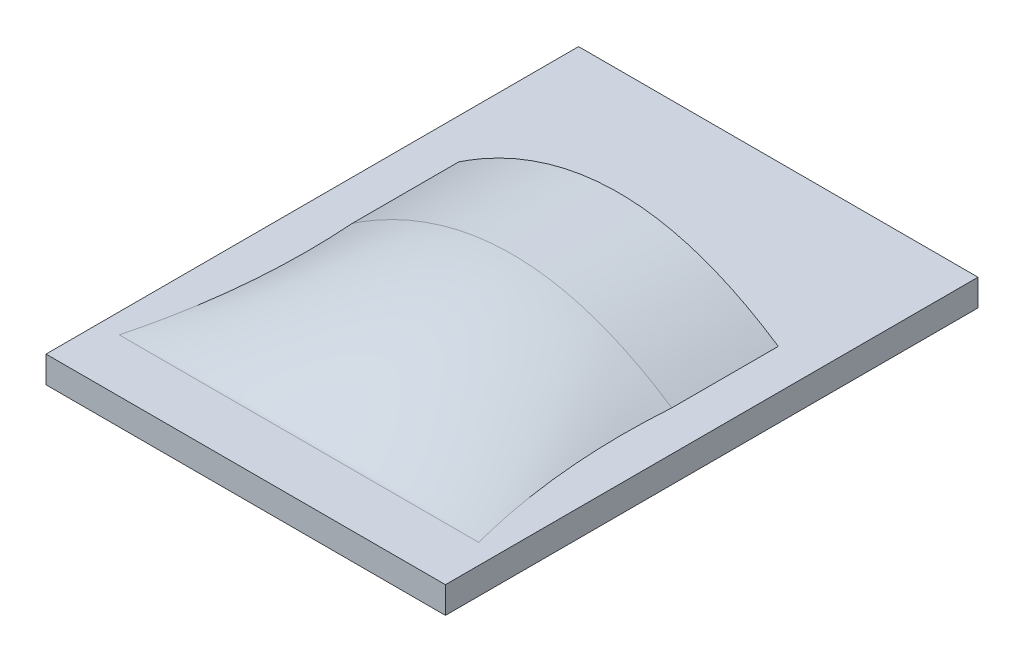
ISO-10303-21;
HEADER;
FILE_DESCRIPTION(('STEP AP214'),'2;1');
FILE_NAME('part.step','',(''),(''),'','','');
FILE_SCHEMA(('AUTOMOTIVE_DESIGN { 1 0 10303 214 1 1 1 1 }'));
ENDSEC;
DATA;
#1=APPLICATION_CONTEXT('core data for automotive mechanical design processes');
#2=APPLICATION_PROTOCOL_DEFINITION('international standard','automotive_design',2000,#1);
#3=PRODUCT_CONTEXT('',#1,'mechanical');
#4=PRODUCT('Part','Part','',(#3));
#5=PRODUCT_RELATED_PRODUCT_CATEGORY('part','',(#4));
#6=PRODUCT_DEFINITION_FORMATION('','',#4);
#7=PRODUCT_DEFINITION_CONTEXT('part definition',#1,'design');
#8=PRODUCT_DEFINITION('design','',#6,#7);
#9=PRODUCT_DEFINITION_SHAPE('','',#8);
#10=(LENGTH_UNIT() NAMED_UNIT(*) SI_UNIT(.MILLI.,.METRE.));
#11=(NAMED_UNIT(*) PLANE_ANGLE_UNIT() SI_UNIT($,.RADIAN.));
#12=(NAMED_UNIT(*) SI_UNIT($,.STERADIAN.) SOLID_ANGLE_UNIT());
#13=UNCERTAINTY_MEASURE_WITH_UNIT(LENGTH_MEASURE(1.E-05),#10,'distance_accuracy_value','');
#14=(GEOMETRIC_REPRESENTATION_CONTEXT(3) GLOBAL_UNCERTAINTY_ASSIGNED_CONTEXT((#13)) GLOBAL_UNIT_ASSIGNED_CONTEXT((#10,
#11,#12)) REPRESENTATION_CONTEXT('',''));
#15=CARTESIAN_POINT('',(0.,0.,0.));
#16=DIRECTION('',(0.,0.,1.));
#17=DIRECTION('',(1.,0.,0.));
#18=AXIS2_PLACEMENT_3D('',#15,#16,#17);
#19=CARTESIAN_POINT('',(75.,0.,100.));
#20=DIRECTION('',(0.,1.,0.));
#21=DIRECTION('',(0.,0.,1.));
#22=AXIS2_PLACEMENT_3D('',#19,#20,#21);
#23=PLANE('',#22);
#24=CARTESIAN_POINT('',(-60.0000000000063,0.,0.));
#25=CARTESIAN_POINT('',(-58.0820118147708,0.,27.0323105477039));
#26=CARTESIAN_POINT('',(-60.5820118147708,0.,53.6989772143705));
#27=CARTESIAN_POINT('',(-67.5,0.,80.));
#28=B_SPLINE_CURVE_WITH_KNOTS('',3,(#24,#25,#26,#27),.UNSPECIFIED.,.F.,.F.,(4,4),(0.,1.),.UNSPECIFIED.);
#29=CARTESIAN_POINT('',(-60.0000000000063,0.,0.));
#30=VERTEX_POINT('',#29);
#31=CARTESIAN_POINT('',(-67.5,0.,80.));
#32=VERTEX_POINT('',#31);
#33=EDGE_CURVE('E181',#30,#32,#28,.T.);
#34=ORIENTED_EDGE('',*,*,#33,.F.);
#35=DIRECTION('',(0.,0.,1.));
#36=VECTOR('',#35,1.);
#37=CARTESIAN_POINT('',(-60.,0.,-40.));
#38=LINE('',#37,#36);
#39=CARTESIAN_POINT('',(-60.0000000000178,-1.33226762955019E-12,-40.));
#40=VERTEX_POINT('',#39);
#41=EDGE_CURVE('E169',#40,#30,#38,.T.);
#42=ORIENTED_EDGE('',*,*,#41,.F.);
#43=DIRECTION('',(1.,0.,0.));
#44=VECTOR('',#43,1.);
#45=CARTESIAN_POINT('',(-60.,0.,-40.));
#46=LINE('',#45,#44);
#47=CARTESIAN_POINT('',(60.0000000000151,-4.44089209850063E-13,-40.));
#48=VERTEX_POINT('',#47);
#49=EDGE_CURVE('E176',#40,#48,#46,.T.);
#50=ORIENTED_EDGE('',*,*,#49,.T.);
#51=DIRECTION('',(0.,0.,1.));
#52=VECTOR('',#51,1.);
#53=CARTESIAN_POINT('',(60.,0.,-40.));
#54=LINE('',#53,#52);
#55=CARTESIAN_POINT('',(60.,0.,0.));
#56=VERTEX_POINT('',#55);
#57=EDGE_CURVE('E167',#48,#56,#54,.T.);
#58=ORIENTED_EDGE('',*,*,#57,.T.);
#59=CARTESIAN_POINT('',(60.,0.,0.));
#60=CARTESIAN_POINT('',(58.0820118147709,0.,27.0323105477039));
#61=CARTESIAN_POINT('',(60.5820118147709,0.,53.6989772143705));
#62=CARTESIAN_POINT('',(67.5,0.,80.));
#63=B_SPLINE_CURVE_WITH_KNOTS('',3,(#59,#60,#61,#62),.UNSPECIFIED.,.F.,.F.,(4,4),(0.,1.),.UNSPECIFIED.);
#64=CARTESIAN_POINT('',(67.5,0.,80.));
#65=VERTEX_POINT('',#64);
#66=EDGE_CURVE('E126',#56,#65,#63,.T.);
#67=ORIENTED_EDGE('',*,*,#66,.T.);
#68=DIRECTION('',(-1.,0.,0.));
#69=VECTOR('',#68,1.);
#70=CARTESIAN_POINT('',(-67.5,0.,80.));
#71=LINE('',#70,#69);
#72=EDGE_CURVE('E120',#65,#32,#71,.T.);
#73=ORIENTED_EDGE('',*,*,#72,.T.);
#74=EDGE_LOOP('',(#34,#42,#50,#58,#67,#73));
#75=FACE_BOUND('',#74,.T.);
#76=DIRECTION('',(0.,0.,-1.));
#77=VECTOR('',#76,1.);
#78=CARTESIAN_POINT('',(75.,0.,-100.));
#79=LINE('',#78,#77);
#80=CARTESIAN_POINT('',(75.,0.,100.));
#81=VERTEX_POINT('',#80);
#82=CARTESIAN_POINT('',(75.,0.,-100.));
#83=VERTEX_POINT('',#82);
#84=EDGE_CURVE('E177',#81,#83,#79,.T.);
#85=ORIENTED_EDGE('',*,*,#84,.T.);
#86=DIRECTION('',(-1.,0.,0.));
#87=VECTOR('',#86,1.);
#88=CARTESIAN_POINT('',(-75.,0.,-100.));
#89=LINE('',#88,#87);
#90=CARTESIAN_POINT('',(-75.,0.,-100.));
#91=VERTEX_POINT('',#90);
#92=EDGE_CURVE('E250',#83,#91,#89,.T.);
#93=ORIENTED_EDGE('',*,*,#92,.T.);
#94=DIRECTION('',(0.,0.,1.));
#95=VECTOR('',#94,1.);
#96=CARTESIAN_POINT('',(-75.,0.,-100.));
#97=LINE('',#96,#95);
#98=CARTESIAN_POINT('',(-75.,0.,100.));
#99=VERTEX_POINT('',#98);
#100=EDGE_CURVE('E253',#91,#99,#97,.T.);
#101=ORIENTED_EDGE('',*,*,#100,.T.);
#102=DIRECTION('',(1.,0.,0.));
#103=VECTOR('',#102,1.);
#104=CARTESIAN_POINT('',(-75.,0.,100.));
#105=LINE('',#104,#103);
#106=EDGE_CURVE('E238',#99,#81,#105,.T.);
#107=ORIENTED_EDGE('',*,*,#106,.T.);
#108=EDGE_LOOP('',(#85,#93,#101,#107));
#109=FACE_BOUND('',#108,.T.);
#110=ADVANCED_FACE('F101',(#75,#109),#23,.T.);
#111=CARTESIAN_POINT('',(75.,-10.,-100.));
#112=DIRECTION('',(1.,0.,0.));
#113=DIRECTION('',(0.,0.,-1.));
#114=AXIS2_PLACEMENT_3D('',#111,#112,#113);
#115=PLANE('',#114);
#116=ORIENTED_EDGE('',*,*,#84,.F.);
#117=DIRECTION('',(0.,1.,0.));
#118=VECTOR('',#117,1.);
#119=CARTESIAN_POINT('',(75.,-10.,100.));
#120=LINE('',#119,#118);
#121=CARTESIAN_POINT('',(75.,-10.,100.));
#122=VERTEX_POINT('',#121);
#123=EDGE_CURVE('E13',#122,#81,#120,.T.);
#124=ORIENTED_EDGE('',*,*,#123,.F.);
#125=DIRECTION('',(0.,0.,-1.));
#126=VECTOR('',#125,1.);
#127=CARTESIAN_POINT('',(75.,-10.,-100.));
#128=LINE('',#127,#126);
#129=CARTESIAN_POINT('',(75.,-10.,-100.));
#130=VERTEX_POINT('',#129);
#131=EDGE_CURVE('E234',#122,#130,#128,.T.);
#132=ORIENTED_EDGE('',*,*,#131,.T.);
#133=DIRECTION('',(0.,1.,0.));
#134=VECTOR('',#133,1.);
#135=CARTESIAN_POINT('',(75.,-10.,-100.));
#136=LINE('',#135,#134);
#137=EDGE_CURVE('E247',#130,#83,#136,.T.);
#138=ORIENTED_EDGE('',*,*,#137,.T.);
#139=EDGE_LOOP('',(#116,#124,#132,#138));
#140=FACE_BOUND('',#139,.T.);
#141=ADVANCED_FACE('F103',(#140),#115,.T.);
#142=CARTESIAN_POINT('',(-75.,-10.,100.));
#143=DIRECTION('',(0.,0.,1.));
#144=DIRECTION('',(1.,0.,0.));
#145=AXIS2_PLACEMENT_3D('',#142,#143,#144);
#146=PLANE('',#145);
#147=ORIENTED_EDGE('',*,*,#106,.F.);
#148=DIRECTION('',(0.,1.,0.));
#149=VECTOR('',#148,1.);
#150=CARTESIAN_POINT('',(-75.,-10.,100.));
#151=LINE('',#150,#149);
#152=CARTESIAN_POINT('',(-75.,-10.,100.));
#153=VERTEX_POINT('',#152);
#154=EDGE_CURVE('E112',#153,#99,#151,.T.);
#155=ORIENTED_EDGE('',*,*,#154,.F.);
#156=DIRECTION('',(1.,0.,0.));
#157=VECTOR('',#156,1.);
#158=CARTESIAN_POINT('',(-75.,-10.,100.));
#159=LINE('',#158,#157);
#160=EDGE_CURVE('E244',#153,#122,#159,.T.);
#161=ORIENTED_EDGE('',*,*,#160,.T.);
#162=ORIENTED_EDGE('',*,*,#123,.T.);
#163=EDGE_LOOP('',(#147,#155,#161,#162));
#164=FACE_BOUND('',#163,.T.);
#165=ADVANCED_FACE('F275',(#164),#146,.T.);
#166=CARTESIAN_POINT('',(-75.,-10.,-100.));
#167=DIRECTION('',(-1.,0.,0.));
#168=DIRECTION('',(0.,0.,1.));
#169=AXIS2_PLACEMENT_3D('',#166,#167,#168);
#170=PLANE('',#169);
#171=ORIENTED_EDGE('',*,*,#100,.F.);
#172=DIRECTION('',(0.,1.,0.));
#173=VECTOR('',#172,1.);
#174=CARTESIAN_POINT('',(-75.,-10.,-100.));
#175=LINE('',#174,#173);
#176=CARTESIAN_POINT('',(-75.,-10.,-100.));
#177=VERTEX_POINT('',#176);
#178=EDGE_CURVE('E259',#177,#91,#175,.T.);
#179=ORIENTED_EDGE('',*,*,#178,.F.);
#180=DIRECTION('',(0.,0.,1.));
#181=VECTOR('',#180,1.);
#182=CARTESIAN_POINT('',(-75.,-10.,-100.));
#183=LINE('',#182,#181);
#184=EDGE_CURVE('E241',#177,#153,#183,.T.);
#185=ORIENTED_EDGE('',*,*,#184,.T.);
#186=ORIENTED_EDGE('',*,*,#154,.T.);
#187=EDGE_LOOP('',(#171,#179,#185,#186));
#188=FACE_BOUND('',#187,.T.);
#189=ADVANCED_FACE('F278',(#188),#170,.T.);
#190=CARTESIAN_POINT('',(-75.,-10.,-100.));
#191=DIRECTION('',(0.,0.,-1.));
#192=DIRECTION('',(-1.,0.,0.));
#193=AXIS2_PLACEMENT_3D('',#190,#191,#192);
#194=PLANE('',#193);
#195=ORIENTED_EDGE('',*,*,#92,.F.);
#196=ORIENTED_EDGE('',*,*,#137,.F.);
#197=DIRECTION('',(-1.,0.,0.));
#198=VECTOR('',#197,1.);
#199=CARTESIAN_POINT('',(-75.,-10.,-100.));
#200=LINE('',#199,#198);
#201=EDGE_CURVE('E237',#130,#177,#200,.T.);
#202=ORIENTED_EDGE('',*,*,#201,.T.);
#203=ORIENTED_EDGE('',*,*,#178,.T.);
#204=EDGE_LOOP('',(#195,#196,#202,#203));
#205=FACE_BOUND('',#204,.T.);
#206=ADVANCED_FACE('F281',(#205),#194,.T.);
#207=CARTESIAN_POINT('',(75.,-10.,100.));
#208=DIRECTION('',(0.,1.,0.));
#209=DIRECTION('',(0.,0.,1.));
#210=AXIS2_PLACEMENT_3D('',#207,#208,#209);
#211=PLANE('',#210);
#212=ORIENTED_EDGE('',*,*,#131,.F.);
#213=ORIENTED_EDGE('',*,*,#160,.F.);
#214=ORIENTED_EDGE('',*,*,#184,.F.);
#215=ORIENTED_EDGE('',*,*,#201,.F.);
#216=EDGE_LOOP('',(#212,#213,#214,#215));
#217=FACE_BOUND('',#216,.T.);
#218=ADVANCED_FACE('F274',(#217),#211,.F.);
#219=CARTESIAN_POINT('',(13416.4078649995,-999980.,-40.));
#220=CARTESIAN_POINT('',(-7.8159700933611E-10,1000020.,-40.));
#221=CARTESIAN_POINT('',(-13416.407864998,-999980.,-40.));
#222=B_SPLINE_CURVE_WITH_KNOTS('',2,(#219,#220,#221),.UNSPECIFIED.,.F.,.F.,(3,3),(0.,1.),.UNSPECIFIED.);
#223=DIRECTION('',(0.,0.,1.));
#224=VECTOR('',#223,1.);
#225=SURFACE_OF_LINEAR_EXTRUSION('',#222,#224);
#226=CARTESIAN_POINT('',(59.9999999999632,-5.50670620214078E-11,0.));
#227=CARTESIAN_POINT('',(19.9999999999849,26.6666666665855,0.));
#228=CARTESIAN_POINT('',(-19.9999999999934,26.6666666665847,0.));
#229=CARTESIAN_POINT('',(-59.9999999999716,-5.7440163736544E-11,0.));
#230=B_SPLINE_CURVE_WITH_KNOTS('',3,(#226,#227,#228,#229),.UNSPECIFIED.,.F.,.F.,(4,4),(0.,1.),.UNSPECIFIED.);
#231=EDGE_CURVE('E164',#56,#30,#230,.T.);
#232=ORIENTED_EDGE('',*,*,#231,.F.);
#233=ORIENTED_EDGE('',*,*,#57,.F.);
#234=EDGE_CURVE('E172',#48,#40,#222,.T.);
#235=ORIENTED_EDGE('',*,*,#234,.T.);
#236=ORIENTED_EDGE('',*,*,#41,.T.);
#237=EDGE_LOOP('',(#232,#233,#235,#236));
#238=FACE_BOUND('',#237,.T.);
#239=ADVANCED_FACE('F165',(#238),#225,.T.);
#240=CARTESIAN_POINT('',(-8.88178419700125E-13,20.0000000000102,-40.));
#241=DIRECTION('',(0.,0.,1.));
#242=DIRECTION('',(1.,0.,0.));
#243=AXIS2_PLACEMENT_3D('',#240,#241,#242);
#244=PLANE('',#243);
#245=ORIENTED_EDGE('',*,*,#234,.F.);
#246=ORIENTED_EDGE('',*,*,#49,.F.);
#247=EDGE_LOOP('',(#245,#246));
#248=FACE_BOUND('',#247,.T.);
#249=ADVANCED_FACE('F206',(#248),#244,.F.);
#250=CARTESIAN_POINT('',(59.9999999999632,-5.50670620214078E-11,0.));
#251=CARTESIAN_POINT('',(58.0820118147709,0.,27.0323105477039));
#252=CARTESIAN_POINT('',(60.5820118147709,0.,53.6989772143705));
#253=CARTESIAN_POINT('',(67.5,0.,80.));
#254=CARTESIAN_POINT('',(19.9999999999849,26.6666666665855,0.));
#255=CARTESIAN_POINT('',(19.9999999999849,26.6666666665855,27.1152147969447));
#256=CARTESIAN_POINT('',(19.13800787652,13.3333333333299,53.8013699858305));
#257=CARTESIAN_POINT('',(22.5,0.,80.));
#258=CARTESIAN_POINT('',(-19.9999999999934,26.6666666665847,0.));
#259=CARTESIAN_POINT('',(-19.9999999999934,26.6666666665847,26.9494062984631));
#260=CARTESIAN_POINT('',(-19.13800787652,13.3333333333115,53.5965844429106));
#261=CARTESIAN_POINT('',(-22.5,0.,80.));
#262=CARTESIAN_POINT('',(-59.9999999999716,-5.7440163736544E-11,0.));
#263=CARTESIAN_POINT('',(-58.0820118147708,0.,27.0323105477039));
#264=CARTESIAN_POINT('',(-60.5820118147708,0.,53.6989772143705));
#265=CARTESIAN_POINT('',(-67.5,0.,80.));
#266=B_SPLINE_SURFACE_WITH_KNOTS('',3,3,((#250,#251,#252,#253),(#254,#255,#256,#257),(#258,#259,
#260,#261),(#262,#263,#264,#265)),.UNSPECIFIED.,.F.,.F.,.F.,(4,4),(4,4),(0.,1.),(0.,1.),.UNSPECIFIED.);
#267=ORIENTED_EDGE('',*,*,#231,.T.);
#268=ORIENTED_EDGE('',*,*,#33,.T.);
#269=ORIENTED_EDGE('',*,*,#72,.F.);
#270=ORIENTED_EDGE('',*,*,#66,.F.);
#271=EDGE_LOOP('',(#267,#268,#269,#270));
#272=FACE_BOUND('',#271,.T.);
#273=ADVANCED_FACE('F179',(#272),#266,.T.);
#274=CLOSED_SHELL('',(#110,#141,#165,#189,#206,#218,#239,#249,#273));
#275=MANIFOLD_SOLID_BREP('B2',#274);
#276=ADVANCED_BREP_SHAPE_REPRESENTATION('',(#18,#275),#14);
#277=SHAPE_DEFINITION_REPRESENTATION(#9,#276);
ENDSEC;
END-ISO-10303-21;
